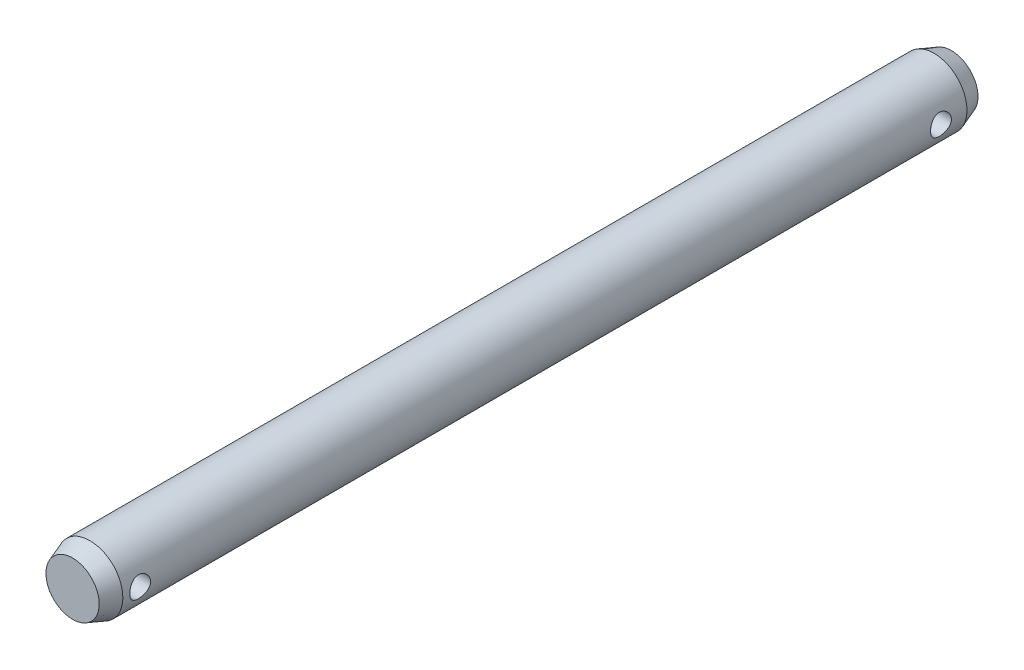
ISO-10303-21;
HEADER;
FILE_DESCRIPTION(('STEP AP214'),'2;1');
FILE_NAME('part.step','',(''),(''),'','','');
FILE_SCHEMA(('AUTOMOTIVE_DESIGN { 1 0 10303 214 1 1 1 1 }'));
ENDSEC;
DATA;
#1=APPLICATION_CONTEXT('core data for automotive mechanical design processes');
#2=APPLICATION_PROTOCOL_DEFINITION('international standard','automotive_design',2000,#1);
#3=PRODUCT_CONTEXT('',#1,'mechanical');
#4=PRODUCT('Part','Part','',(#3));
#5=PRODUCT_RELATED_PRODUCT_CATEGORY('part','',(#4));
#6=PRODUCT_DEFINITION_FORMATION('','',#4);
#7=PRODUCT_DEFINITION_CONTEXT('part definition',#1,'design');
#8=PRODUCT_DEFINITION('design','',#6,#7);
#9=PRODUCT_DEFINITION_SHAPE('','',#8);
#10=(LENGTH_UNIT() NAMED_UNIT(*) SI_UNIT(.MILLI.,.METRE.));
#11=(NAMED_UNIT(*) PLANE_ANGLE_UNIT() SI_UNIT($,.RADIAN.));
#12=(NAMED_UNIT(*) SI_UNIT($,.STERADIAN.) SOLID_ANGLE_UNIT());
#13=UNCERTAINTY_MEASURE_WITH_UNIT(LENGTH_MEASURE(1.E-05),#10,'distance_accuracy_value','');
#14=(GEOMETRIC_REPRESENTATION_CONTEXT(3) GLOBAL_UNCERTAINTY_ASSIGNED_CONTEXT((#13)) GLOBAL_UNIT_ASSIGNED_CONTEXT((#10,
#11,#12)) REPRESENTATION_CONTEXT('',''));
#15=CARTESIAN_POINT('',(0.,0.,0.));
#16=DIRECTION('',(0.,0.,1.));
#17=DIRECTION('',(1.,0.,0.));
#18=AXIS2_PLACEMENT_3D('',#15,#16,#17);
#19=CARTESIAN_POINT('',(0.,0.,64.389));
#20=DIRECTION('',(0.,0.,-1.));
#21=DIRECTION('',(-1.,0.,0.));
#22=AXIS2_PLACEMENT_3D('',#19,#20,#21);
#23=CYLINDRICAL_SURFACE('',#22,4.826);
#24=CARTESIAN_POINT('',(-4.826,0.,-56.515));
#25=CARTESIAN_POINT('',(-4.82599967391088,-0.0833968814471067,-56.5150004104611));
#26=CARTESIAN_POINT('',(-4.82381792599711,-0.166798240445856,-56.5218680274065));
#27=CARTESIAN_POINT('',(-4.81532842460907,-0.3311592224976,-56.5490831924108));
#28=CARTESIAN_POINT('',(-4.80901981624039,-0.412118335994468,-56.5694335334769));
#29=CARTESIAN_POINT('',(-4.79296519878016,-0.569201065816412,-56.622857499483));
#30=CARTESIAN_POINT('',(-4.78322457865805,-0.645332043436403,-56.6559111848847));
#31=CARTESIAN_POINT('',(-4.76130988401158,-0.790970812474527,-56.7337179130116));
#32=CARTESIAN_POINT('',(-4.7491354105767,-0.860477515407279,-56.7784728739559));
#33=CARTESIAN_POINT('',(-4.72321510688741,-0.993082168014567,-56.8798936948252));
#34=CARTESIAN_POINT('',(-4.7094345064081,-1.05594248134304,-56.9368613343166));
#35=CARTESIAN_POINT('',(-4.68205491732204,-1.17139458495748,-57.0604480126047));
#36=CARTESIAN_POINT('',(-4.66845596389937,-1.2239844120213,-57.1270688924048));
#37=CARTESIAN_POINT('',(-4.64260485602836,-1.31870162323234,-57.2701407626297));
#38=CARTESIAN_POINT('',(-4.63039553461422,-1.36053029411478,-57.3467979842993));
#39=CARTESIAN_POINT('',(-4.6092299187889,-1.43060307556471,-57.5065067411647));
#40=CARTESIAN_POINT('',(-4.60027274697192,-1.45885085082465,-57.5895565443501));
#41=CARTESIAN_POINT('',(-4.58698966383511,-1.50008705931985,-57.7570080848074));
#42=CARTESIAN_POINT('',(-4.58253010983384,-1.51351701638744,-57.8412901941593));
#43=CARTESIAN_POINT('',(-4.57835062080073,-1.52611589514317,-58.0110202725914));
#44=CARTESIAN_POINT('',(-4.57862939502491,-1.5252887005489,-58.0964679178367));
#45=CARTESIAN_POINT('',(-4.58377722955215,-1.5097416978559,-58.2624341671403));
#46=CARTESIAN_POINT('',(-4.58846008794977,-1.49558540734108,-58.3430123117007));
#47=CARTESIAN_POINT('',(-4.60158562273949,-1.45469658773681,-58.5005855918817));
#48=CARTESIAN_POINT('',(-4.61002870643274,-1.42796269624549,-58.5775803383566));
#49=CARTESIAN_POINT('',(-4.62986451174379,-1.36228413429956,-58.7271340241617));
#50=CARTESIAN_POINT('',(-4.64129916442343,-1.32316406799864,-58.7996101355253));
#51=CARTESIAN_POINT('',(-4.66581075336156,-1.23394542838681,-58.9371529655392));
#52=CARTESIAN_POINT('',(-4.67888812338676,-1.18384395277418,-59.002217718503));
#53=CARTESIAN_POINT('',(-4.70595643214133,-1.07132853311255,-59.1262737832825));
#54=CARTESIAN_POINT('',(-4.71996156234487,-1.00845006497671,-59.1848414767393));
#55=CARTESIAN_POINT('',(-4.74677122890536,-0.873589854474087,-59.2907051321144));
#56=CARTESIAN_POINT('',(-4.75957567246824,-0.801607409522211,-59.3380002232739));
#57=CARTESIAN_POINT('',(-4.78268063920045,-0.649753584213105,-59.4202713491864));
#58=CARTESIAN_POINT('',(-4.79296002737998,-0.56982299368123,-59.4551444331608));
#59=CARTESIAN_POINT('',(-4.80970400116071,-0.404829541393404,-59.5108230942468));
#60=CARTESIAN_POINT('',(-4.81616977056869,-0.319768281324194,-59.5316330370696));
#61=CARTESIAN_POINT('',(-4.82436663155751,-0.150522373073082,-59.5578686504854));
#62=CARTESIAN_POINT('',(-4.82627407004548,-0.0664350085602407,-59.5638676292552));
#63=CARTESIAN_POINT('',(-4.82566203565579,0.101554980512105,-59.561930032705));
#64=CARTESIAN_POINT('',(-4.82314322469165,0.18545763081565,-59.5539955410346));
#65=CARTESIAN_POINT('',(-4.81407768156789,0.348472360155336,-59.5248755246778));
#66=CARTESIAN_POINT('',(-4.80763521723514,0.427652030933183,-59.5040327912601));
#67=CARTESIAN_POINT('',(-4.7914785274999,0.58136695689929,-59.4501077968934));
#68=CARTESIAN_POINT('',(-4.78176389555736,0.655901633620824,-59.417024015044));
#69=CARTESIAN_POINT('',(-4.75976134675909,0.800258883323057,-59.3386437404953));
#70=CARTESIAN_POINT('',(-4.7474158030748,0.86991962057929,-59.2930658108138));
#71=CARTESIAN_POINT('',(-4.72156139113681,1.00079545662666,-59.1913275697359));
#72=CARTESIAN_POINT('',(-4.70805220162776,1.06200821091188,-59.1351643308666));
#73=CARTESIAN_POINT('',(-4.68070335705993,1.17682607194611,-59.0111528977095));
#74=CARTESIAN_POINT('',(-4.66687249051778,1.23002243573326,-58.9429234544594));
#75=CARTESIAN_POINT('',(-4.64101660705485,1.3242493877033,-58.7982059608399));
#76=CARTESIAN_POINT('',(-4.62899156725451,1.3652801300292,-58.7217180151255));
#77=CARTESIAN_POINT('',(-4.6082403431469,1.43376445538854,-58.5627866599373));
#78=CARTESIAN_POINT('',(-4.59950222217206,1.46126728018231,-58.480366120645));
#79=CARTESIAN_POINT('',(-4.586396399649,1.50190171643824,-58.3117301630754));
#80=CARTESIAN_POINT('',(-4.58202698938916,1.5150389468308,-58.2255162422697));
#81=CARTESIAN_POINT('',(-4.57833391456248,1.52616022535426,-58.0560211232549));
#82=CARTESIAN_POINT('',(-4.57878656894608,1.52481599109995,-57.9727883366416));
#83=CARTESIAN_POINT('',(-4.58414174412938,1.508638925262,-57.8077973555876));
#84=CARTESIAN_POINT('',(-4.58904404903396,1.49380674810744,-57.7260390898));
#85=CARTESIAN_POINT('',(-4.6025882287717,1.45152861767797,-57.567547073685));
#86=CARTESIAN_POINT('',(-4.61117184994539,1.424278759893,-57.490755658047));
#87=CARTESIAN_POINT('',(-4.63109556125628,1.35809380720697,-57.3427738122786));
#88=CARTESIAN_POINT('',(-4.64243622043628,1.31915629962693,-57.2715845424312));
#89=CARTESIAN_POINT('',(-4.66715975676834,1.22888796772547,-57.1337574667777));
#90=CARTESIAN_POINT('',(-4.68060598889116,1.17712525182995,-57.0674139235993));
#91=CARTESIAN_POINT('',(-4.70773842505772,1.06343118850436,-56.9441372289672));
#92=CARTESIAN_POINT('',(-4.72142469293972,1.00149709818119,-56.887206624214));
#93=CARTESIAN_POINT('',(-4.74804682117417,0.866715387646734,-56.782454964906));
#94=CARTESIAN_POINT('',(-4.76094201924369,0.79357100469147,-56.7350042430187));
#95=CARTESIAN_POINT('',(-4.78401257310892,0.639937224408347,-56.6531336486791));
#96=CARTESIAN_POINT('',(-4.79418894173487,0.559450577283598,-56.6187089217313));
#97=CARTESIAN_POINT('',(-4.81001469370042,0.399934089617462,-56.5662076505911));
#98=CARTESIAN_POINT('',(-4.81595643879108,0.321284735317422,-56.547061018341));
#99=CARTESIAN_POINT('',(-4.82394883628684,0.161758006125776,-56.5214583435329));
#100=CARTESIAN_POINT('',(-4.82600031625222,0.0808811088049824,-56.514999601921));
#101=CARTESIAN_POINT('',(-4.826,0.,-56.515));
#102=B_SPLINE_CURVE_WITH_KNOTS('',3,(#24,#25,#26,#27,#28,#29,#30,#31,#32,#33,#34,#35,#36,#37,
#38,#39,#40,#41,#42,#43,#44,#45,#46,#47,#48,#49,#50,#51,#52,#53,#54,#55,#56,#57,#58,#59,#60,#61,
#62,#63,#64,#65,#66,#67,#68,#69,#70,#71,#72,#73,#74,#75,#76,#77,#78,#79,#80,#81,#82,#83,#84,#85,
#86,#87,#88,#89,#90,#91,#92,#93,#94,#95,#96,#97,#98,#99,#100,#101),.UNSPECIFIED.,.T.,.F.,(4,2,2,
2,2,2,2,2,2,2,2,2,2,2,2,2,2,2,2,2,2,2,2,2,2,2,2,2,2,2,2,2,2,2,2,2,2,2,4),(0.,0.249893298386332,
0.499838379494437,0.749392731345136,0.99898801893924,1.25566136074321,1.5123837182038,
1.77560802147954,2.0387612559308,2.29384180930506,2.54885287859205,2.79354495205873,
3.03826353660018,3.28661536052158,3.53503290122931,3.79501244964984,4.05501207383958,
4.31711895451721,4.57914443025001,4.83085616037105,5.08253025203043,5.32779162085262,
5.57308347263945,5.82443327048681,6.07585268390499,6.33745916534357,6.5990623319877,
6.85970608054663,7.12024784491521,7.36875853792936,7.61725717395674,7.86196076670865,
8.10671490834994,8.36121859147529,8.61579101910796,8.87891667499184,9.14194417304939,
9.38435069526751,9.62670564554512),.UNSPECIFIED.);
#103=CARTESIAN_POINT('',(-4.826,0.,-56.515));
#104=VERTEX_POINT('',#103);
#105=EDGE_CURVE('E28',#104,#104,#102,.T.);
#106=ORIENTED_EDGE('',*,*,#105,.T.);
#107=EDGE_LOOP('',(#106));
#108=FACE_BOUND('',#107,.T.);
#109=CARTESIAN_POINT('',(4.826,0.,-59.563));
#110=CARTESIAN_POINT('',(4.82599967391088,-0.0833968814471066,-59.5629995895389));
#111=CARTESIAN_POINT('',(4.82381792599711,-0.166798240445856,-59.5561319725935));
#112=CARTESIAN_POINT('',(4.81532842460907,-0.3311592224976,-59.5289168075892));
#113=CARTESIAN_POINT('',(4.80901981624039,-0.412118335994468,-59.5085664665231));
#114=CARTESIAN_POINT('',(4.79296519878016,-0.569201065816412,-59.4551425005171));
#115=CARTESIAN_POINT('',(4.78322457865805,-0.645332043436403,-59.4220888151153));
#116=CARTESIAN_POINT('',(4.76130988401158,-0.790970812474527,-59.3442820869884));
#117=CARTESIAN_POINT('',(4.7491354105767,-0.860477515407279,-59.2995271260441));
#118=CARTESIAN_POINT('',(4.72321510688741,-0.993082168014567,-59.1981063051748));
#119=CARTESIAN_POINT('',(4.7094345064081,-1.05594248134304,-59.1411386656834));
#120=CARTESIAN_POINT('',(4.68205491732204,-1.17139458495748,-59.0175519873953));
#121=CARTESIAN_POINT('',(4.66845596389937,-1.2239844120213,-58.9509311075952));
#122=CARTESIAN_POINT('',(4.64260485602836,-1.31870162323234,-58.8078592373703));
#123=CARTESIAN_POINT('',(4.63039553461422,-1.36053029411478,-58.7312020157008));
#124=CARTESIAN_POINT('',(4.6092299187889,-1.43060307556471,-58.5714932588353));
#125=CARTESIAN_POINT('',(4.60027274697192,-1.45885085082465,-58.4884434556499));
#126=CARTESIAN_POINT('',(4.58698966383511,-1.50008705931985,-58.3209919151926));
#127=CARTESIAN_POINT('',(4.58253010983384,-1.51351701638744,-58.2367098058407));
#128=CARTESIAN_POINT('',(4.57835062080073,-1.52611589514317,-58.0669797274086));
#129=CARTESIAN_POINT('',(4.57862939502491,-1.5252887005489,-57.9815320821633));
#130=CARTESIAN_POINT('',(4.58377722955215,-1.5097416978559,-57.8155658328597));
#131=CARTESIAN_POINT('',(4.58846008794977,-1.49558540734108,-57.7349876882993));
#132=CARTESIAN_POINT('',(4.60158562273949,-1.45469658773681,-57.5774144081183));
#133=CARTESIAN_POINT('',(4.61002870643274,-1.42796269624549,-57.5004196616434));
#134=CARTESIAN_POINT('',(4.62986451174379,-1.36228413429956,-57.3508659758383));
#135=CARTESIAN_POINT('',(4.64129916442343,-1.32316406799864,-57.2783898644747));
#136=CARTESIAN_POINT('',(4.66581075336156,-1.23394542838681,-57.1408470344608));
#137=CARTESIAN_POINT('',(4.67888812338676,-1.18384395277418,-57.075782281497));
#138=CARTESIAN_POINT('',(4.70595643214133,-1.07132853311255,-56.9517262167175));
#139=CARTESIAN_POINT('',(4.71996156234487,-1.00845006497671,-56.8931585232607));
#140=CARTESIAN_POINT('',(4.74677122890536,-0.873589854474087,-56.7872948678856));
#141=CARTESIAN_POINT('',(4.75957567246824,-0.801607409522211,-56.7399997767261));
#142=CARTESIAN_POINT('',(4.78268063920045,-0.649753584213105,-56.6577286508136));
#143=CARTESIAN_POINT('',(4.79296002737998,-0.569822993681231,-56.6228555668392));
#144=CARTESIAN_POINT('',(4.80970400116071,-0.404829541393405,-56.5671769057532));
#145=CARTESIAN_POINT('',(4.81616977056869,-0.319768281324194,-56.5463669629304));
#146=CARTESIAN_POINT('',(4.82436663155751,-0.150522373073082,-56.5201313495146));
#147=CARTESIAN_POINT('',(4.82627407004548,-0.0664350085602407,-56.5141323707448));
#148=CARTESIAN_POINT('',(4.82566203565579,0.101554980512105,-56.516069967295));
#149=CARTESIAN_POINT('',(4.82314322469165,0.18545763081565,-56.5240044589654));
#150=CARTESIAN_POINT('',(4.81407768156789,0.348472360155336,-56.5531244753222));
#151=CARTESIAN_POINT('',(4.80763521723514,0.427652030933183,-56.5739672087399));
#152=CARTESIAN_POINT('',(4.7914785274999,0.58136695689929,-56.6278922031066));
#153=CARTESIAN_POINT('',(4.78176389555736,0.655901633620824,-56.660975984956));
#154=CARTESIAN_POINT('',(4.75976134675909,0.800258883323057,-56.7393562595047));
#155=CARTESIAN_POINT('',(4.7474158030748,0.86991962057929,-56.7849341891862));
#156=CARTESIAN_POINT('',(4.72156139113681,1.00079545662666,-56.8866724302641));
#157=CARTESIAN_POINT('',(4.70805220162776,1.06200821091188,-56.9428356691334));
#158=CARTESIAN_POINT('',(4.68070335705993,1.17682607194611,-57.0668471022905));
#159=CARTESIAN_POINT('',(4.66687249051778,1.23002243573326,-57.1350765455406));
#160=CARTESIAN_POINT('',(4.64101660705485,1.3242493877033,-57.2797940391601));
#161=CARTESIAN_POINT('',(4.62899156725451,1.3652801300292,-57.3562819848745));
#162=CARTESIAN_POINT('',(4.6082403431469,1.43376445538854,-57.5152133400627));
#163=CARTESIAN_POINT('',(4.59950222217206,1.46126728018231,-57.597633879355));
#164=CARTESIAN_POINT('',(4.586396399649,1.50190171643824,-57.7662698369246));
#165=CARTESIAN_POINT('',(4.58202698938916,1.5150389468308,-57.8524837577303));
#166=CARTESIAN_POINT('',(4.57833391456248,1.52616022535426,-58.0219788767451));
#167=CARTESIAN_POINT('',(4.57878656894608,1.52481599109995,-58.1052116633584));
#168=CARTESIAN_POINT('',(4.58414174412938,1.508638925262,-58.2702026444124));
#169=CARTESIAN_POINT('',(4.58904404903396,1.49380674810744,-58.3519609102));
#170=CARTESIAN_POINT('',(4.6025882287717,1.45152861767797,-58.510452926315));
#171=CARTESIAN_POINT('',(4.61117184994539,1.424278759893,-58.587244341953));
#172=CARTESIAN_POINT('',(4.63109556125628,1.35809380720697,-58.7352261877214));
#173=CARTESIAN_POINT('',(4.64243622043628,1.31915629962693,-58.8064154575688));
#174=CARTESIAN_POINT('',(4.66715975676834,1.22888796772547,-58.9442425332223));
#175=CARTESIAN_POINT('',(4.68060598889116,1.17712525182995,-59.0105860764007));
#176=CARTESIAN_POINT('',(4.70773842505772,1.06343118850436,-59.1338627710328));
#177=CARTESIAN_POINT('',(4.72142469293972,1.00149709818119,-59.190793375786));
#178=CARTESIAN_POINT('',(4.74804682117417,0.866715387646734,-59.295545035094));
#179=CARTESIAN_POINT('',(4.76094201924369,0.79357100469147,-59.3429957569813));
#180=CARTESIAN_POINT('',(4.78401257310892,0.639937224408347,-59.4248663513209));
#181=CARTESIAN_POINT('',(4.79418894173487,0.559450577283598,-59.4592910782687));
#182=CARTESIAN_POINT('',(4.81001469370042,0.399934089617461,-59.5117923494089));
#183=CARTESIAN_POINT('',(4.81595643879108,0.32128473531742,-59.530938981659));
#184=CARTESIAN_POINT('',(4.82394883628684,0.161758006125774,-59.5565416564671));
#185=CARTESIAN_POINT('',(4.82600031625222,0.0808811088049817,-59.563000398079));
#186=CARTESIAN_POINT('',(4.826,0.,-59.563));
#187=B_SPLINE_CURVE_WITH_KNOTS('',3,(#109,#110,#111,#112,#113,#114,#115,#116,#117,#118,#119,
#120,#121,#122,#123,#124,#125,#126,#127,#128,#129,#130,#131,#132,#133,#134,#135,#136,#137,#138,
#139,#140,#141,#142,#143,#144,#145,#146,#147,#148,#149,#150,#151,#152,#153,#154,#155,#156,#157,
#158,#159,#160,#161,#162,#163,#164,#165,#166,#167,#168,#169,#170,#171,#172,#173,#174,#175,#176,
#177,#178,#179,#180,#181,#182,#183,#184,#185,#186),.UNSPECIFIED.,.T.,.F.,(4,2,2,2,2,2,2,2,2,2,2,
2,2,2,2,2,2,2,2,2,2,2,2,2,2,2,2,2,2,2,2,2,2,2,2,2,2,2,4),(0.,0.249893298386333,
0.499838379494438,0.749392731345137,0.99898801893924,1.25566136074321,1.5123837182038,
1.77560802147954,2.0387612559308,2.29384180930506,2.54885287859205,2.79354495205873,
3.03826353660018,3.28661536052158,3.53503290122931,3.79501244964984,4.05501207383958,
4.31711895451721,4.57914443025,4.83085616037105,5.08253025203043,5.32779162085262,
5.57308347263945,5.8244332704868,6.07585268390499,6.33745916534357,6.59906233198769,
6.85970608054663,7.12024784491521,7.36875853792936,7.61725717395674,7.86196076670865,
8.10671490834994,8.36121859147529,8.61579101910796,8.87891667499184,9.14194417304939,
9.38435069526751,9.62670564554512),.UNSPECIFIED.);
#188=CARTESIAN_POINT('',(4.826,0.,-59.563));
#189=VERTEX_POINT('',#188);
#190=EDGE_CURVE('E102',#189,#189,#187,.T.);
#191=ORIENTED_EDGE('',*,*,#190,.T.);
#192=EDGE_LOOP('',(#191));
#193=FACE_BOUND('',#192,.T.);
#194=CARTESIAN_POINT('',(-4.826,0.,60.833));
#195=CARTESIAN_POINT('',(-4.82599967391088,-0.0833968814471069,60.8329995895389));
#196=CARTESIAN_POINT('',(-4.82381792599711,-0.166798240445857,60.8261319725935));
#197=CARTESIAN_POINT('',(-4.81532842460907,-0.331159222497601,60.7989168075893));
#198=CARTESIAN_POINT('',(-4.80901981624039,-0.412118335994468,60.7785664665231));
#199=CARTESIAN_POINT('',(-4.79296519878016,-0.569201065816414,60.725142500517));
#200=CARTESIAN_POINT('',(-4.78322457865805,-0.645332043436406,60.6920888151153));
#201=CARTESIAN_POINT('',(-4.76130988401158,-0.790970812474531,60.6142820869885));
#202=CARTESIAN_POINT('',(-4.7491354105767,-0.860477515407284,60.5695271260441));
#203=CARTESIAN_POINT('',(-4.72321510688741,-0.993082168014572,60.4681063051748));
#204=CARTESIAN_POINT('',(-4.7094345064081,-1.05594248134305,60.4111386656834));
#205=CARTESIAN_POINT('',(-4.68205491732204,-1.17139458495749,60.2875519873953));
#206=CARTESIAN_POINT('',(-4.66845596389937,-1.2239844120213,60.2209311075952));
#207=CARTESIAN_POINT('',(-4.64260485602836,-1.31870162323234,60.0778592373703));
#208=CARTESIAN_POINT('',(-4.63039553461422,-1.36053029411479,60.0012020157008));
#209=CARTESIAN_POINT('',(-4.6092299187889,-1.43060307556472,59.8414932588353));
#210=CARTESIAN_POINT('',(-4.60027274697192,-1.45885085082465,59.7584434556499));
#211=CARTESIAN_POINT('',(-4.58698966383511,-1.50008705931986,59.5909919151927));
#212=CARTESIAN_POINT('',(-4.58253010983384,-1.51351701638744,59.5067098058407));
#213=CARTESIAN_POINT('',(-4.57835062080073,-1.52611589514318,59.3369797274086));
#214=CARTESIAN_POINT('',(-4.57862939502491,-1.52528870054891,59.2515320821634));
#215=CARTESIAN_POINT('',(-4.58377722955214,-1.50974169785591,59.0855658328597));
#216=CARTESIAN_POINT('',(-4.58846008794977,-1.49558540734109,59.0049876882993));
#217=CARTESIAN_POINT('',(-4.60158562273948,-1.45469658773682,58.8474144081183));
#218=CARTESIAN_POINT('',(-4.61002870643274,-1.4279626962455,58.7704196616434));
#219=CARTESIAN_POINT('',(-4.62986451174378,-1.36228413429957,58.6208659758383));
#220=CARTESIAN_POINT('',(-4.64129916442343,-1.32316406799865,58.5483898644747));
#221=CARTESIAN_POINT('',(-4.66581075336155,-1.23394542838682,58.4108470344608));
#222=CARTESIAN_POINT('',(-4.67888812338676,-1.1838439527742,58.345782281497));
#223=CARTESIAN_POINT('',(-4.70595643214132,-1.07132853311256,58.2217262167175));
#224=CARTESIAN_POINT('',(-4.71996156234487,-1.00845006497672,58.1631585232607));
#225=CARTESIAN_POINT('',(-4.74677122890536,-0.873589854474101,58.0572948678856));
#226=CARTESIAN_POINT('',(-4.75957567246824,-0.801607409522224,58.0099997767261));
#227=CARTESIAN_POINT('',(-4.78268063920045,-0.649753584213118,57.9277286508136));
#228=CARTESIAN_POINT('',(-4.79296002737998,-0.569822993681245,57.8928555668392));
#229=CARTESIAN_POINT('',(-4.8097040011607,-0.404829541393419,57.8371769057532));
#230=CARTESIAN_POINT('',(-4.81616977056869,-0.319768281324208,57.8163669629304));
#231=CARTESIAN_POINT('',(-4.82436663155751,-0.150522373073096,57.7901313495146));
#232=CARTESIAN_POINT('',(-4.82627407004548,-0.0664350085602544,57.7841323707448));
#233=CARTESIAN_POINT('',(-4.82566203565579,0.101554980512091,57.786069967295));
#234=CARTESIAN_POINT('',(-4.82314322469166,0.185457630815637,57.7940044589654));
#235=CARTESIAN_POINT('',(-4.81407768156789,0.348472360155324,57.8231244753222));
#236=CARTESIAN_POINT('',(-4.80763521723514,0.427652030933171,57.8439672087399));
#237=CARTESIAN_POINT('',(-4.7914785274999,0.581366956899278,57.8978922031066));
#238=CARTESIAN_POINT('',(-4.78176389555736,0.655901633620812,57.930975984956));
#239=CARTESIAN_POINT('',(-4.75976134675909,0.800258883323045,58.0093562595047));
#240=CARTESIAN_POINT('',(-4.7474158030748,0.869919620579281,58.0549341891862));
#241=CARTESIAN_POINT('',(-4.72156139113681,1.00079545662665,58.1566724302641));
#242=CARTESIAN_POINT('',(-4.70805220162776,1.06200821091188,58.2128356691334));
#243=CARTESIAN_POINT('',(-4.68070335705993,1.1768260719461,58.3368471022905));
#244=CARTESIAN_POINT('',(-4.66687249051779,1.23002243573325,58.4050765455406));
#245=CARTESIAN_POINT('',(-4.64101660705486,1.32424938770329,58.5497940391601));
#246=CARTESIAN_POINT('',(-4.62899156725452,1.36528013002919,58.6262819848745));
#247=CARTESIAN_POINT('',(-4.6082403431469,1.43376445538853,58.7852133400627));
#248=CARTESIAN_POINT('',(-4.59950222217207,1.4612672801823,58.867633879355));
#249=CARTESIAN_POINT('',(-4.58639639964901,1.50190171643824,59.0362698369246));
#250=CARTESIAN_POINT('',(-4.58202698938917,1.51503894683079,59.1224837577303));
#251=CARTESIAN_POINT('',(-4.57833391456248,1.52616022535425,59.2919788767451));
#252=CARTESIAN_POINT('',(-4.57878656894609,1.52481599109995,59.3752116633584));
#253=CARTESIAN_POINT('',(-4.58414174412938,1.50863892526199,59.5402026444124));
#254=CARTESIAN_POINT('',(-4.58904404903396,1.49380674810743,59.6219609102));
#255=CARTESIAN_POINT('',(-4.6025882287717,1.45152861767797,59.780452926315));
#256=CARTESIAN_POINT('',(-4.61117184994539,1.424278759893,59.857244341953));
#257=CARTESIAN_POINT('',(-4.63109556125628,1.35809380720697,60.0052261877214));
#258=CARTESIAN_POINT('',(-4.64243622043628,1.31915629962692,60.0764154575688));
#259=CARTESIAN_POINT('',(-4.66715975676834,1.22888796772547,60.2142425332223));
#260=CARTESIAN_POINT('',(-4.68060598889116,1.17712525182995,60.2805860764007));
#261=CARTESIAN_POINT('',(-4.70773842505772,1.06343118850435,60.4038627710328));
#262=CARTESIAN_POINT('',(-4.72142469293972,1.00149709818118,60.460793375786));
#263=CARTESIAN_POINT('',(-4.74804682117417,0.866715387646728,60.565545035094));
#264=CARTESIAN_POINT('',(-4.76094201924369,0.793571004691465,60.6129957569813));
#265=CARTESIAN_POINT('',(-4.78401257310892,0.639937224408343,60.6948663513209));
#266=CARTESIAN_POINT('',(-4.79418894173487,0.559450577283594,60.7292910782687));
#267=CARTESIAN_POINT('',(-4.81001469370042,0.399934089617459,60.7817923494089));
#268=CARTESIAN_POINT('',(-4.81595643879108,0.321284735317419,60.800938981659));
#269=CARTESIAN_POINT('',(-4.82394883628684,0.161758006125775,60.8265416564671));
#270=CARTESIAN_POINT('',(-4.82600031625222,0.080881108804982,60.833000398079));
#271=CARTESIAN_POINT('',(-4.826,0.,60.833));
#272=B_SPLINE_CURVE_WITH_KNOTS('',3,(#194,#195,#196,#197,#198,#199,#200,#201,#202,#203,#204,
#205,#206,#207,#208,#209,#210,#211,#212,#213,#214,#215,#216,#217,#218,#219,#220,#221,#222,#223,
#224,#225,#226,#227,#228,#229,#230,#231,#232,#233,#234,#235,#236,#237,#238,#239,#240,#241,#242,
#243,#244,#245,#246,#247,#248,#249,#250,#251,#252,#253,#254,#255,#256,#257,#258,#259,#260,#261,
#262,#263,#264,#265,#266,#267,#268,#269,#270,#271),.UNSPECIFIED.,.T.,.F.,(4,2,2,2,2,2,2,2,2,2,2,
2,2,2,2,2,2,2,2,2,2,2,2,2,2,2,2,2,2,2,2,2,2,2,2,2,2,2,4),(0.,0.249893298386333,0.49983837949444,
0.749392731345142,0.998988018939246,1.25566136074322,1.5123837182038,1.77560802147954,
2.0387612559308,2.29384180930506,2.54885287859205,2.79354495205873,3.03826353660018,
3.28661536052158,3.53503290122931,3.79501244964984,4.05501207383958,4.31711895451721,
4.57914443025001,4.83085616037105,5.08253025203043,5.32779162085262,5.57308347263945,
5.82443327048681,6.07585268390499,6.33745916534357,6.5990623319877,6.85970608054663,
7.12024784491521,7.36875853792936,7.61725717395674,7.86196076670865,8.10671490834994,
8.36121859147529,8.61579101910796,8.87891667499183,9.14194417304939,9.38435069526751,
9.62670564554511),.UNSPECIFIED.);
#273=CARTESIAN_POINT('',(-4.826,0.,60.833));
#274=VERTEX_POINT('',#273);
#275=EDGE_CURVE('E50',#274,#274,#272,.T.);
#276=ORIENTED_EDGE('',*,*,#275,.T.);
#277=EDGE_LOOP('',(#276));
#278=FACE_BOUND('',#277,.T.);
#279=CARTESIAN_POINT('',(4.826,0.,57.785));
#280=CARTESIAN_POINT('',(4.82599967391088,-0.083396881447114,57.7850004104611));
#281=CARTESIAN_POINT('',(4.82381792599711,-0.166798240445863,57.7918680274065));
#282=CARTESIAN_POINT('',(4.81532842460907,-0.331159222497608,57.8190831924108));
#283=CARTESIAN_POINT('',(4.80901981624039,-0.412118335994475,57.8394335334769));
#284=CARTESIAN_POINT('',(4.79296519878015,-0.56920106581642,57.892857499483));
#285=CARTESIAN_POINT('',(4.78322457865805,-0.645332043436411,57.9259111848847));
#286=CARTESIAN_POINT('',(4.76130988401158,-0.790970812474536,58.0037179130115));
#287=CARTESIAN_POINT('',(4.7491354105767,-0.860477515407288,58.0484728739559));
#288=CARTESIAN_POINT('',(4.72321510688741,-0.993082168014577,58.1498936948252));
#289=CARTESIAN_POINT('',(4.7094345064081,-1.05594248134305,58.2068613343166));
#290=CARTESIAN_POINT('',(4.68205491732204,-1.17139458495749,58.3304480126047));
#291=CARTESIAN_POINT('',(4.66845596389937,-1.22398441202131,58.3970688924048));
#292=CARTESIAN_POINT('',(4.64260485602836,-1.31870162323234,58.5401407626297));
#293=CARTESIAN_POINT('',(4.63039553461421,-1.36053029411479,58.6167979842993));
#294=CARTESIAN_POINT('',(4.6092299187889,-1.43060307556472,58.7765067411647));
#295=CARTESIAN_POINT('',(4.60027274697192,-1.45885085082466,58.8595565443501));
#296=CARTESIAN_POINT('',(4.58698966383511,-1.50008705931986,59.0270080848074));
#297=CARTESIAN_POINT('',(4.58253010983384,-1.51351701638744,59.1112901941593));
#298=CARTESIAN_POINT('',(4.57835062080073,-1.52611589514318,59.2810202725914));
#299=CARTESIAN_POINT('',(4.57862939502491,-1.52528870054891,59.3664679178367));
#300=CARTESIAN_POINT('',(4.58377722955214,-1.50974169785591,59.5324341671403));
#301=CARTESIAN_POINT('',(4.58846008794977,-1.49558540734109,59.6130123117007));
#302=CARTESIAN_POINT('',(4.60158562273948,-1.45469658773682,59.7705855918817));
#303=CARTESIAN_POINT('',(4.61002870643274,-1.4279626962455,59.8475803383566));
#304=CARTESIAN_POINT('',(4.62986451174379,-1.36228413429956,59.9971340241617));
#305=CARTESIAN_POINT('',(4.64129916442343,-1.32316406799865,60.0696101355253));
#306=CARTESIAN_POINT('',(4.66581075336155,-1.23394542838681,60.2071529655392));
#307=CARTESIAN_POINT('',(4.67888812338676,-1.18384395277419,60.272217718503));
#308=CARTESIAN_POINT('',(4.70595643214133,-1.07132853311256,60.3962737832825));
#309=CARTESIAN_POINT('',(4.71996156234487,-1.00845006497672,60.4548414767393));
#310=CARTESIAN_POINT('',(4.74677122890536,-0.873589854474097,60.5607051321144));
#311=CARTESIAN_POINT('',(4.75957567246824,-0.801607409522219,60.6080002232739));
#312=CARTESIAN_POINT('',(4.78268063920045,-0.649753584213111,60.6902713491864));
#313=CARTESIAN_POINT('',(4.79296002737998,-0.569822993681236,60.7251444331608));
#314=CARTESIAN_POINT('',(4.80970400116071,-0.40482954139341,60.7808230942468));
#315=CARTESIAN_POINT('',(4.81616977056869,-0.319768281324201,60.8016330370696));
#316=CARTESIAN_POINT('',(4.82436663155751,-0.15052237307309,60.8278686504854));
#317=CARTESIAN_POINT('',(4.82627407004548,-0.0664350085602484,60.8338676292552));
#318=CARTESIAN_POINT('',(4.82566203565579,0.101554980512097,60.831930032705));
#319=CARTESIAN_POINT('',(4.82314322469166,0.185457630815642,60.8239955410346));
#320=CARTESIAN_POINT('',(4.81407768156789,0.348472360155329,60.7948755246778));
#321=CARTESIAN_POINT('',(4.80763521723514,0.427652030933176,60.7740327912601));
#322=CARTESIAN_POINT('',(4.7914785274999,0.581366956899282,60.7201077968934));
#323=CARTESIAN_POINT('',(4.78176389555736,0.655901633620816,60.687024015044));
#324=CARTESIAN_POINT('',(4.75976134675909,0.800258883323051,60.6086437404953));
#325=CARTESIAN_POINT('',(4.7474158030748,0.869919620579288,60.5630658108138));
#326=CARTESIAN_POINT('',(4.72156139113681,1.00079545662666,60.4613275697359));
#327=CARTESIAN_POINT('',(4.70805220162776,1.06200821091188,60.4051643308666));
#328=CARTESIAN_POINT('',(4.68070335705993,1.1768260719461,60.2811528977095));
#329=CARTESIAN_POINT('',(4.66687249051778,1.23002243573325,60.2129234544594));
#330=CARTESIAN_POINT('',(4.64101660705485,1.32424938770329,60.0682059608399));
#331=CARTESIAN_POINT('',(4.62899156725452,1.3652801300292,59.9917180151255));
#332=CARTESIAN_POINT('',(4.6082403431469,1.43376445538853,59.8327866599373));
#333=CARTESIAN_POINT('',(4.59950222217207,1.4612672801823,59.750366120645));
#334=CARTESIAN_POINT('',(4.586396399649,1.50190171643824,59.5817301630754));
#335=CARTESIAN_POINT('',(4.58202698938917,1.51503894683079,59.4955162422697));
#336=CARTESIAN_POINT('',(4.57833391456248,1.52616022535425,59.3260211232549));
#337=CARTESIAN_POINT('',(4.57878656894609,1.52481599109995,59.2427883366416));
#338=CARTESIAN_POINT('',(4.58414174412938,1.50863892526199,59.0777973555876));
#339=CARTESIAN_POINT('',(4.58904404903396,1.49380674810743,58.9960390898));
#340=CARTESIAN_POINT('',(4.6025882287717,1.45152861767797,58.837547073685));
#341=CARTESIAN_POINT('',(4.61117184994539,1.424278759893,58.760755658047));
#342=CARTESIAN_POINT('',(4.63109556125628,1.35809380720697,58.6127738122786));
#343=CARTESIAN_POINT('',(4.64243622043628,1.31915629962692,58.5415845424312));
#344=CARTESIAN_POINT('',(4.66715975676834,1.22888796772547,58.4037574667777));
#345=CARTESIAN_POINT('',(4.68060598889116,1.17712525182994,58.3374139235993));
#346=CARTESIAN_POINT('',(4.70773842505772,1.06343118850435,58.2141372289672));
#347=CARTESIAN_POINT('',(4.72142469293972,1.00149709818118,58.157206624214));
#348=CARTESIAN_POINT('',(4.74804682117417,0.866715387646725,58.052454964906));
#349=CARTESIAN_POINT('',(4.76094201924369,0.79357100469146,58.0050042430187));
#350=CARTESIAN_POINT('',(4.78401257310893,0.639937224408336,57.9231336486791));
#351=CARTESIAN_POINT('',(4.79418894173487,0.559450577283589,57.8887089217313));
#352=CARTESIAN_POINT('',(4.81001469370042,0.399934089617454,57.8362076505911));
#353=CARTESIAN_POINT('',(4.81595643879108,0.321284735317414,57.8170610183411));
#354=CARTESIAN_POINT('',(4.82394883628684,0.161758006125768,57.7914583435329));
#355=CARTESIAN_POINT('',(4.82600031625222,0.0808811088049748,57.784999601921));
#356=CARTESIAN_POINT('',(4.826,0.,57.785));
#357=B_SPLINE_CURVE_WITH_KNOTS('',3,(#279,#280,#281,#282,#283,#284,#285,#286,#287,#288,#289,
#290,#291,#292,#293,#294,#295,#296,#297,#298,#299,#300,#301,#302,#303,#304,#305,#306,#307,#308,
#309,#310,#311,#312,#313,#314,#315,#316,#317,#318,#319,#320,#321,#322,#323,#324,#325,#326,#327,
#328,#329,#330,#331,#332,#333,#334,#335,#336,#337,#338,#339,#340,#341,#342,#343,#344,#345,#346,
#347,#348,#349,#350,#351,#352,#353,#354,#355,#356),.UNSPECIFIED.,.T.,.F.,(4,2,2,2,2,2,2,2,2,2,2,
2,2,2,2,2,2,2,2,2,2,2,2,2,2,2,2,2,2,2,2,2,2,2,2,2,2,2,4),(0.,0.249893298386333,
0.499838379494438,0.749392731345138,0.998988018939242,1.25566136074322,1.5123837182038,
1.77560802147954,2.0387612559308,2.29384180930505,2.54885287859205,2.79354495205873,
3.03826353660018,3.28661536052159,3.53503290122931,3.79501244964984,4.05501207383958,
4.31711895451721,4.57914443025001,4.83085616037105,5.08253025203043,5.32779162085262,
5.57308347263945,5.82443327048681,6.07585268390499,6.33745916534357,6.5990623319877,
6.85970608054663,7.1202478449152,7.36875853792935,7.61725717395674,7.86196076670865,
8.10671490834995,8.36121859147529,8.61579101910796,8.87891667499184,9.14194417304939,
9.38435069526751,9.62670564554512),.UNSPECIFIED.);
#358=CARTESIAN_POINT('',(4.826,0.,57.785));
#359=VERTEX_POINT('',#358);
#360=EDGE_CURVE('E44',#359,#359,#357,.T.);
#361=ORIENTED_EDGE('',*,*,#360,.T.);
#362=EDGE_LOOP('',(#361));
#363=FACE_BOUND('',#362,.T.);
#364=CARTESIAN_POINT('',(0.,0.,-61.849));
#365=DIRECTION('',(0.,0.,1.));
#366=DIRECTION('',(1.,0.,0.));
#367=AXIS2_PLACEMENT_3D('',#364,#365,#366);
#368=CIRCLE('',#367,4.826);
#369=CARTESIAN_POINT('',(4.826,0.,-61.849));
#370=VERTEX_POINT('',#369);
#371=EDGE_CURVE('E35',#370,#370,#368,.T.);
#372=ORIENTED_EDGE('',*,*,#371,.T.);
#373=EDGE_LOOP('',(#372));
#374=FACE_BOUND('',#373,.T.);
#375=CARTESIAN_POINT('',(0.,0.,61.849));
#376=DIRECTION('',(0.,0.,1.));
#377=DIRECTION('',(1.,0.,0.));
#378=AXIS2_PLACEMENT_3D('',#375,#376,#377);
#379=CIRCLE('',#378,4.826);
#380=CARTESIAN_POINT('',(4.826,0.,61.849));
#381=VERTEX_POINT('',#380);
#382=EDGE_CURVE('E40',#381,#381,#379,.F.);
#383=ORIENTED_EDGE('',*,*,#382,.T.);
#384=EDGE_LOOP('',(#383));
#385=FACE_BOUND('',#384,.T.);
#386=ADVANCED_FACE('F24',(#108,#193,#278,#363,#374,#385),#23,.T.);
#387=CARTESIAN_POINT('',(0.,0.,64.389));
#388=DIRECTION('',(0.,0.,1.));
#389=DIRECTION('',(1.,0.,0.));
#390=AXIS2_PLACEMENT_3D('',#387,#388,#389);
#391=PLANE('',#390);
#392=CARTESIAN_POINT('',(0.,0.,64.389));
#393=DIRECTION('',(0.,0.,1.));
#394=DIRECTION('',(1.,0.,0.));
#395=AXIS2_PLACEMENT_3D('',#392,#393,#394);
#396=CIRCLE('',#395,3.90151560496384);
#397=CARTESIAN_POINT('',(3.90151560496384,0.,64.389));
#398=VERTEX_POINT('',#397);
#399=EDGE_CURVE('E80',#398,#398,#396,.T.);
#400=ORIENTED_EDGE('',*,*,#399,.T.);
#401=EDGE_LOOP('',(#400));
#402=FACE_BOUND('',#401,.T.);
#403=ADVANCED_FACE('F71',(#402),#391,.T.);
#404=CARTESIAN_POINT('',(0.,0.,-64.389));
#405=DIRECTION('',(0.,0.,1.));
#406=DIRECTION('',(1.,0.,0.));
#407=AXIS2_PLACEMENT_3D('',#404,#405,#406);
#408=PLANE('',#407);
#409=CARTESIAN_POINT('',(0.,0.,-64.389));
#410=DIRECTION('',(0.,0.,1.));
#411=DIRECTION('',(1.,0.,0.));
#412=AXIS2_PLACEMENT_3D('',#409,#410,#411);
#413=CIRCLE('',#412,3.90151560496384);
#414=CARTESIAN_POINT('',(3.90151560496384,0.,-64.389));
#415=VERTEX_POINT('',#414);
#416=EDGE_CURVE('E10',#415,#415,#413,.F.);
#417=ORIENTED_EDGE('',*,*,#416,.T.);
#418=EDGE_LOOP('',(#417));
#419=FACE_BOUND('',#418,.T.);
#420=ADVANCED_FACE('F68',(#419),#408,.F.);
#421=CARTESIAN_POINT('',(0.,0.,64.389));
#422=DIRECTION('',(0.,0.,-1.));
#423=DIRECTION('',(-1.,0.,0.));
#424=AXIS2_PLACEMENT_3D('',#421,#422,#423);
#425=CONICAL_SURFACE('',#424,3.90151560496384,0.349065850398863);
#426=ORIENTED_EDGE('',*,*,#382,.F.);
#427=EDGE_LOOP('',(#426));
#428=FACE_BOUND('',#427,.T.);
#429=ORIENTED_EDGE('',*,*,#399,.F.);
#430=EDGE_LOOP('',(#429));
#431=FACE_BOUND('',#430,.T.);
#432=ADVANCED_FACE('F64',(#428,#431),#425,.T.);
#433=CARTESIAN_POINT('',(0.,0.,-61.849));
#434=DIRECTION('',(0.,0.,1.));
#435=DIRECTION('',(1.,0.,0.));
#436=AXIS2_PLACEMENT_3D('',#433,#434,#435);
#437=CONICAL_SURFACE('',#436,4.826,0.349065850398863);
#438=ORIENTED_EDGE('',*,*,#416,.F.);
#439=EDGE_LOOP('',(#438));
#440=FACE_BOUND('',#439,.T.);
#441=ORIENTED_EDGE('',*,*,#371,.F.);
#442=EDGE_LOOP('',(#441));
#443=FACE_BOUND('',#442,.T.);
#444=ADVANCED_FACE('F58',(#440,#443),#437,.T.);
#445=CARTESIAN_POINT('',(-12.7,0.,59.309));
#446=DIRECTION('',(1.,0.,0.));
#447=DIRECTION('',(0.,0.,-1.));
#448=AXIS2_PLACEMENT_3D('',#445,#446,#447);
#449=CYLINDRICAL_SURFACE('',#448,1.524);
#450=ORIENTED_EDGE('',*,*,#360,.F.);
#451=EDGE_LOOP('',(#450));
#452=FACE_BOUND('',#451,.T.);
#453=ORIENTED_EDGE('',*,*,#275,.F.);
#454=EDGE_LOOP('',(#453));
#455=FACE_BOUND('',#454,.T.);
#456=ADVANCED_FACE('F53',(#452,#455),#449,.F.);
#457=CARTESIAN_POINT('',(-12.7,0.,-58.039));
#458=DIRECTION('',(1.,0.,0.));
#459=DIRECTION('',(0.,0.,-1.));
#460=AXIS2_PLACEMENT_3D('',#457,#458,#459);
#461=CYLINDRICAL_SURFACE('',#460,1.524);
#462=ORIENTED_EDGE('',*,*,#190,.F.);
#463=EDGE_LOOP('',(#462));
#464=FACE_BOUND('',#463,.T.);
#465=ORIENTED_EDGE('',*,*,#105,.F.);
#466=EDGE_LOOP('',(#465));
#467=FACE_BOUND('',#466,.T.);
#468=ADVANCED_FACE('F57',(#464,#467),#461,.F.);
#469=CLOSED_SHELL('',(#386,#403,#420,#432,#444,#456,#468));
#470=MANIFOLD_SOLID_BREP('B2',#469);
#471=ADVANCED_BREP_SHAPE_REPRESENTATION('',(#18,#470),#14);
#472=SHAPE_DEFINITION_REPRESENTATION(#9,#471);
ENDSEC;
END-ISO-10303-21;
